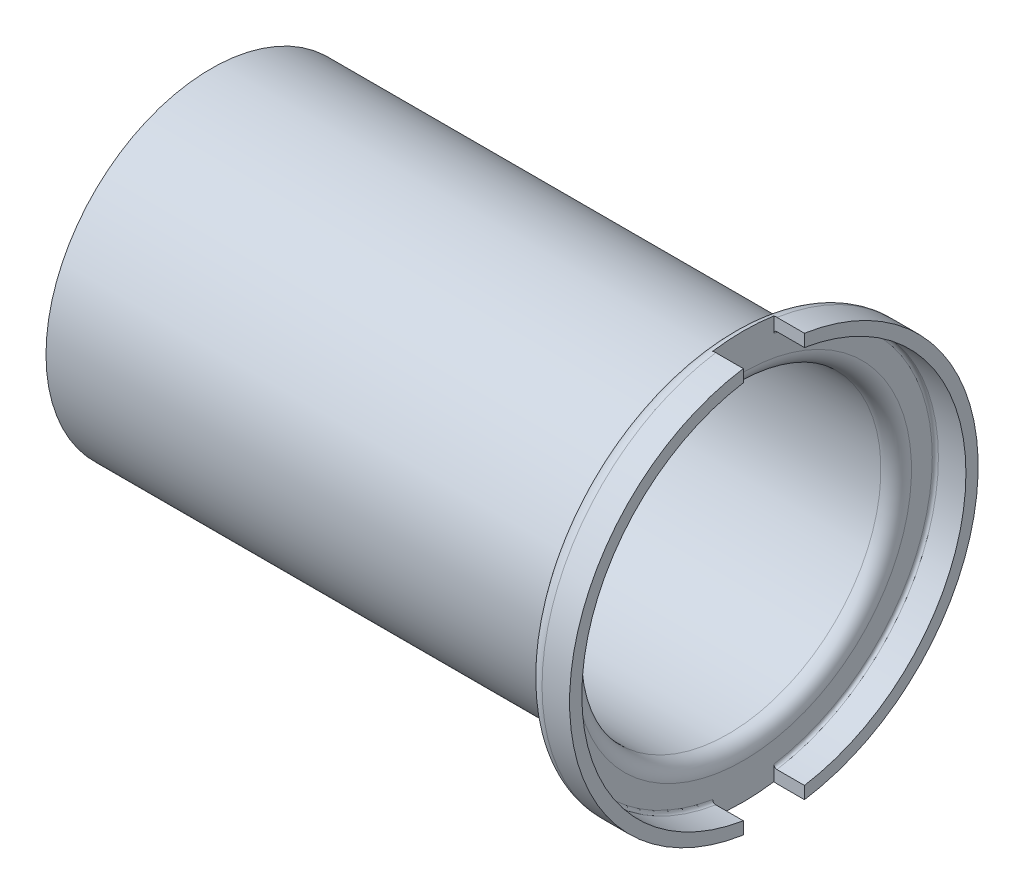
ISO-10303-21;
HEADER;
FILE_DESCRIPTION(('STEP AP214'),'2;1');
FILE_NAME('part.step','',(''),(''),'','','');
FILE_SCHEMA(('AUTOMOTIVE_DESIGN { 1 0 10303 214 1 1 1 1 }'));
ENDSEC;
DATA;
#1=APPLICATION_CONTEXT('core data for automotive mechanical design processes');
#2=APPLICATION_PROTOCOL_DEFINITION('international standard','automotive_design',2000,#1);
#3=PRODUCT_CONTEXT('',#1,'mechanical');
#4=PRODUCT('Part','Part','',(#3));
#5=PRODUCT_RELATED_PRODUCT_CATEGORY('part','',(#4));
#6=PRODUCT_DEFINITION_FORMATION('','',#4);
#7=PRODUCT_DEFINITION_CONTEXT('part definition',#1,'design');
#8=PRODUCT_DEFINITION('design','',#6,#7);
#9=PRODUCT_DEFINITION_SHAPE('','',#8);
#10=(LENGTH_UNIT() NAMED_UNIT(*) SI_UNIT(.MILLI.,.METRE.));
#11=(NAMED_UNIT(*) PLANE_ANGLE_UNIT() SI_UNIT($,.RADIAN.));
#12=(NAMED_UNIT(*) SI_UNIT($,.STERADIAN.) SOLID_ANGLE_UNIT());
#13=UNCERTAINTY_MEASURE_WITH_UNIT(LENGTH_MEASURE(1.E-05),#10,'distance_accuracy_value','');
#14=(GEOMETRIC_REPRESENTATION_CONTEXT(3) GLOBAL_UNCERTAINTY_ASSIGNED_CONTEXT((#13)) GLOBAL_UNIT_ASSIGNED_CONTEXT((#10,
#11,#12)) REPRESENTATION_CONTEXT('',''));
#15=CARTESIAN_POINT('',(0.,0.,0.));
#16=DIRECTION('',(0.,0.,1.));
#17=DIRECTION('',(1.,0.,0.));
#18=AXIS2_PLACEMENT_3D('',#15,#16,#17);
#19=CARTESIAN_POINT('',(0.,0.,0.));
#20=DIRECTION('',(-1.,0.,0.));
#21=DIRECTION('',(0.,0.,1.));
#22=AXIS2_PLACEMENT_3D('',#19,#20,#21);
#23=CYLINDRICAL_SURFACE('',#22,31.4);
#24=CARTESIAN_POINT('',(87.5,0.,0.));
#25=DIRECTION('',(-1.,0.,0.));
#26=DIRECTION('',(0.,0.,1.));
#27=AXIS2_PLACEMENT_3D('',#24,#25,#26);
#28=CIRCLE('',#27,31.4);
#29=CARTESIAN_POINT('',(87.5,-30.9993548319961,5.));
#30=VERTEX_POINT('',#29);
#31=CARTESIAN_POINT('',(87.5000000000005,30.9993548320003,5.));
#32=VERTEX_POINT('',#31);
#33=EDGE_CURVE('E252',#30,#32,#28,.T.);
#34=ORIENTED_EDGE('',*,*,#33,.T.);
#35=DIRECTION('',(-1.,0.,0.));
#36=VECTOR('',#35,1.);
#37=CARTESIAN_POINT('',(0.,30.9993548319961,5.00000000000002));
#38=LINE('',#37,#36);
#39=CARTESIAN_POINT('',(92.,30.9993548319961,5.));
#40=VERTEX_POINT('',#39);
#41=EDGE_CURVE('E201',#32,#40,#38,.F.);
#42=ORIENTED_EDGE('',*,*,#41,.T.);
#43=CARTESIAN_POINT('',(92.,0.,0.));
#44=DIRECTION('',(-1.,0.,0.));
#45=DIRECTION('',(0.,0.,1.));
#46=AXIS2_PLACEMENT_3D('',#43,#44,#45);
#47=CIRCLE('',#46,31.4);
#48=CARTESIAN_POINT('',(92.,-30.9993548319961,5.));
#49=VERTEX_POINT('',#48);
#50=EDGE_CURVE('E216',#49,#40,#47,.T.);
#51=ORIENTED_EDGE('',*,*,#50,.F.);
#52=DIRECTION('',(-1.,0.,0.));
#53=VECTOR('',#52,1.);
#54=CARTESIAN_POINT('',(0.,-30.9993548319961,5.00000000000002));
#55=LINE('',#54,#53);
#56=EDGE_CURVE('E213',#49,#30,#55,.T.);
#57=ORIENTED_EDGE('',*,*,#56,.T.);
#58=EDGE_LOOP('',(#34,#42,#51,#57));
#59=FACE_BOUND('',#58,.T.);
#60=ADVANCED_FACE('F32',(#59),#23,.F.);
#61=CARTESIAN_POINT('',(87.5,0.,0.));
#62=DIRECTION('',(-1.,0.,0.));
#63=DIRECTION('',(0.,0.,1.));
#64=AXIS2_PLACEMENT_3D('',#61,#62,#63);
#65=TOROIDAL_SURFACE('',#64,30.9,0.5);
#66=ORIENTED_EDGE('',*,*,#33,.F.);
#67=CARTESIAN_POINT('',(87.2534090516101,-30.9334756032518,5.));
#68=CARTESIAN_POINT('',(87.2289089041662,-30.919404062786,5.));
#69=CARTESIAN_POINT('',(87.2055893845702,-30.9032325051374,5.));
#70=CARTESIAN_POINT('',(87.1619882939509,-30.8671774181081,5.));
#71=CARTESIAN_POINT('',(87.1417108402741,-30.8472889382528,5.));
#72=CARTESIAN_POINT('',(87.1047906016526,-30.80441830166,5.));
#73=CARTESIAN_POINT('',(87.0881441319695,-30.781439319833,5.));
#74=CARTESIAN_POINT('',(87.0589087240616,-30.7330414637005,5.));
#75=CARTESIAN_POINT('',(87.0463187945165,-30.7076231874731,5.));
#76=CARTESIAN_POINT('',(87.0254177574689,-30.6548088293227,5.));
#77=CARTESIAN_POINT('',(87.0171477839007,-30.6273964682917,5.));
#78=CARTESIAN_POINT('',(87.0052796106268,-30.5715769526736,5.));
#79=CARTESIAN_POINT('',(87.0016818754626,-30.5431696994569,5.));
#80=CARTESIAN_POINT('',(86.9992392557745,-30.4858875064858,5.));
#81=CARTESIAN_POINT('',(87.000438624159,-30.4570106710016,5.));
#82=CARTESIAN_POINT('',(87.0076582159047,-30.3998653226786,5.));
#83=CARTESIAN_POINT('',(87.0136785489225,-30.3715968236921,5.));
#84=CARTESIAN_POINT('',(87.0303972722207,-30.31642146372,5.));
#85=CARTESIAN_POINT('',(87.0411041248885,-30.2895171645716,5.));
#86=CARTESIAN_POINT('',(87.0669121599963,-30.237904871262,5.));
#87=CARTESIAN_POINT('',(87.0820132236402,-30.2131968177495,5.));
#88=CARTESIAN_POINT('',(87.1160829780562,-30.1668639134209,5.));
#89=CARTESIAN_POINT('',(87.1350250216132,-30.1452194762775,5.));
#90=CARTESIAN_POINT('',(87.176315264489,-30.1054674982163,5.));
#91=CARTESIAN_POINT('',(87.1986632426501,-30.0873597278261,5.));
#92=CARTESIAN_POINT('',(87.2458342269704,-30.0554384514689,5.));
#93=CARTESIAN_POINT('',(87.2706229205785,-30.0415742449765,5.));
#94=CARTESIAN_POINT('',(87.3221978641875,-30.0182655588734,5.));
#95=CARTESIAN_POINT('',(87.3489839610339,-30.0088207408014,5.));
#96=CARTESIAN_POINT('',(87.4034312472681,-29.9947360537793,5.));
#97=CARTESIAN_POINT('',(87.4310772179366,-29.9900373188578,5.));
#98=CARTESIAN_POINT('',(87.4867651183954,-29.985383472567,5.));
#99=CARTESIAN_POINT('',(87.5148070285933,-29.9854281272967,5.));
#100=CARTESIAN_POINT('',(87.5702876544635,-29.9902425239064,5.));
#101=CARTESIAN_POINT('',(87.5977291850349,-29.9949799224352,5.));
#102=CARTESIAN_POINT('',(87.6514295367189,-30.0089860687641,5.));
#103=CARTESIAN_POINT('',(87.6776883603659,-30.0182548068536,5.));
#104=CARTESIAN_POINT('',(87.728340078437,-30.0410657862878,5.));
#105=CARTESIAN_POINT('',(87.7527291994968,-30.0546164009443,5.));
#106=CARTESIAN_POINT('',(87.7989154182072,-30.0855822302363,5.));
#107=CARTESIAN_POINT('',(87.8207124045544,-30.1029976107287,5.));
#108=CARTESIAN_POINT('',(87.8613285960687,-30.1413748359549,5.));
#109=CARTESIAN_POINT('',(87.880116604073,-30.1623696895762,5.));
#110=CARTESIAN_POINT('',(87.9139562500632,-30.2071803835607,5.));
#111=CARTESIAN_POINT('',(87.9290076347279,-30.2309964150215,5.));
#112=CARTESIAN_POINT('',(87.9551551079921,-30.2811090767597,5.));
#113=CARTESIAN_POINT('',(87.9661965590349,-30.3074342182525,5.));
#114=CARTESIAN_POINT('',(87.9837566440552,-30.3615521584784,5.));
#115=CARTESIAN_POINT('',(87.9902749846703,-30.389345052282,5.));
#116=CARTESIAN_POINT('',(87.9986657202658,-30.4459297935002,5.));
#117=CARTESIAN_POINT('',(88.0004874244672,-30.4747291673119,5.));
#118=CARTESIAN_POINT('',(87.9992898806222,-30.5322277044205,5.));
#119=CARTESIAN_POINT('',(87.99627047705,-30.5609268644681,5.));
#120=CARTESIAN_POINT('',(87.9854476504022,-30.6175196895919,5.));
#121=CARTESIAN_POINT('',(87.9776265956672,-30.6454099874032,5.));
#122=CARTESIAN_POINT('',(87.9573907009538,-30.6994721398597,5.));
#123=CARTESIAN_POINT('',(87.9449759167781,-30.7256440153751,5.));
#124=CARTESIAN_POINT('',(87.9159578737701,-30.7753821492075,5.));
#125=CARTESIAN_POINT('',(87.8993753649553,-30.7989605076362,5.));
#126=CARTESIAN_POINT('',(87.8624456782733,-30.8429584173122,5.));
#127=CARTESIAN_POINT('',(87.8420987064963,-30.8633781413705,5.));
#128=CARTESIAN_POINT('',(87.7984581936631,-30.9002313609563,5.));
#129=CARTESIAN_POINT('',(87.7752001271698,-30.9167068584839,5.));
#130=CARTESIAN_POINT('',(87.7262207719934,-30.94546032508,5.));
#131=CARTESIAN_POINT('',(87.7004997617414,-30.9577387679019,5.));
#132=CARTESIAN_POINT('',(87.6476734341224,-30.977591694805,5.));
#133=CARTESIAN_POINT('',(87.6205896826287,-30.9852235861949,5.));
#134=CARTESIAN_POINT('',(87.5655133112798,-30.9957904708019,5.));
#135=CARTESIAN_POINT('',(87.5375205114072,-30.9987245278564,5.));
#136=CARTESIAN_POINT('',(87.4816685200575,-30.9997986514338,5.));
#137=CARTESIAN_POINT('',(87.4538100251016,-30.9979764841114,5.));
#138=CARTESIAN_POINT('',(87.3988208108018,-30.9896736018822,5.));
#139=CARTESIAN_POINT('',(87.371689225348,-30.983198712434,5.));
#140=CARTESIAN_POINT('',(87.3293467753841,-30.9692469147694,5.));
#141=CARTESIAN_POINT('',(87.3136585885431,-30.9631748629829,5.));
#142=CARTESIAN_POINT('',(87.2829773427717,-30.9494748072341,5.));
#143=CARTESIAN_POINT('',(87.2679842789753,-30.9418468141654,5.));
#144=CARTESIAN_POINT('',(87.2534090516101,-30.9334756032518,5.));
#145=B_SPLINE_CURVE_WITH_KNOTS('',3,(#67,#68,#69,#70,#71,#72,#73,#74,#75,#76,#77,#78,#79,#80,
#81,#82,#83,#84,#85,#86,#87,#88,#89,#90,#91,#92,#93,#94,#95,#96,#97,#98,#99,#100,#101,#102,#103,
#104,#105,#106,#107,#108,#109,#110,#111,#112,#113,#114,#115,#116,#117,#118,#119,#120,#121,#122,
#123,#124,#125,#126,#127,#128,#129,#130,#131,#132,#133,#134,#135,#136,#137,#138,#139,#140,#141,
#142,#143,#144),.UNSPECIFIED.,.T.,.F.,(4,2,2,2,2,2,2,2,2,2,2,2,2,2,2,2,2,2,2,2,2,2,2,2,2,2,2,2,
2,2,2,2,2,2,2,2,2,2,4),(0.,0.0846984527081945,0.16951052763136,0.254236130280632,
0.338941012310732,0.424438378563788,0.50994424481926,0.596240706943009,0.682539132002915,
0.768994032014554,0.855446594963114,0.941318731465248,1.02718529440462,1.1119818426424,
1.19677189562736,1.28049687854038,1.36421773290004,1.44736555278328,1.53051319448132,
1.61382445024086,1.69713928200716,1.78126867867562,1.86540377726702,1.95064569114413,
2.03589313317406,2.12205687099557,2.20822337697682,2.29470819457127,2.38119196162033,
2.46725339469,2.55331011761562,2.63840501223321,2.72349029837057,2.8075018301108,
2.89153010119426,2.97489319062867,3.05815208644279,3.10853985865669,3.15892727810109),.UNSPECIFIED.);
#146=CARTESIAN_POINT('',(87.,-30.4927860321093,5.));
#147=VERTEX_POINT('',#146);
#148=EDGE_CURVE('E208',#30,#147,#145,.T.);
#149=ORIENTED_EDGE('',*,*,#148,.T.);
#150=CARTESIAN_POINT('',(87.,0.,0.));
#151=DIRECTION('',(-1.,0.,0.));
#152=DIRECTION('',(0.,0.,1.));
#153=AXIS2_PLACEMENT_3D('',#150,#151,#152);
#154=CIRCLE('',#153,30.9);
#155=CARTESIAN_POINT('',(87.,30.4927860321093,5.));
#156=VERTEX_POINT('',#155);
#157=EDGE_CURVE('E248',#147,#156,#154,.T.);
#158=ORIENTED_EDGE('',*,*,#157,.T.);
#159=CARTESIAN_POINT('',(87.1171087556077,30.1668960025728,4.99999999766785));
#160=CARTESIAN_POINT('',(87.0988467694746,30.1889405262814,4.99999999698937));
#161=CARTESIAN_POINT('',(87.0824479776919,30.212557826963,4.99999999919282));
#162=CARTESIAN_POINT('',(87.0538432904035,30.2622359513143,5.00000000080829));
#163=CARTESIAN_POINT('',(87.0416431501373,30.2883000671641,5.00000000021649));
#164=CARTESIAN_POINT('',(87.0217878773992,30.3420809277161,4.9999999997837));
#165=CARTESIAN_POINT('',(87.0141286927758,30.369796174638,4.99999999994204));
#166=CARTESIAN_POINT('',(87.0035421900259,30.426106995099,5.00000000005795));
#167=CARTESIAN_POINT('',(87.0006136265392,30.4547023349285,5.00000000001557));
#168=CARTESIAN_POINT('',(86.9995567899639,30.5121614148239,4.99999999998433));
#169=CARTESIAN_POINT('',(87.0014586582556,30.5410257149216,4.9999999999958));
#170=CARTESIAN_POINT('',(87.01007859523,30.5980282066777,5.0000000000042));
#171=CARTESIAN_POINT('',(87.016796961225,30.6261663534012,5.00000000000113));
#172=CARTESIAN_POINT('',(87.0348778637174,30.680921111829,4.99999999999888));
#173=CARTESIAN_POINT('',(87.0462420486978,30.7075371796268,4.9999999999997));
#174=CARTESIAN_POINT('',(87.0733113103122,30.7584629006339,5.0000000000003));
#175=CARTESIAN_POINT('',(87.0890162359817,30.7827726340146,5.00000000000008));
#176=CARTESIAN_POINT('',(87.1241992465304,30.8281868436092,4.99999999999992));
#177=CARTESIAN_POINT('',(87.1436470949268,30.849314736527,4.99999999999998));
#178=CARTESIAN_POINT('',(87.1858533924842,30.8879552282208,5.00000000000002));
#179=CARTESIAN_POINT('',(87.20861161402,30.9054680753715,5.00000000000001));
#180=CARTESIAN_POINT('',(87.2564914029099,30.9361495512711,5.));
#181=CARTESIAN_POINT('',(87.281580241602,30.9493692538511,5.));
#182=CARTESIAN_POINT('',(87.3336397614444,30.9713524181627,5.));
#183=CARTESIAN_POINT('',(87.360610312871,30.9801161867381,5.));
#184=CARTESIAN_POINT('',(87.4153334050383,30.9928410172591,5.));
#185=CARTESIAN_POINT('',(87.4430733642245,30.9968562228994,5.));
#186=CARTESIAN_POINT('',(87.4988324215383,31.0001427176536,5.));
#187=CARTESIAN_POINT('',(87.526851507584,30.9994142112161,5.));
#188=CARTESIAN_POINT('',(87.5822041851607,30.9932540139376,5.));
#189=CARTESIAN_POINT('',(87.609540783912,30.9878492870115,5.));
#190=CARTESIAN_POINT('',(87.6629217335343,30.9725375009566,5.));
#191=CARTESIAN_POINT('',(87.6889660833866,30.9626304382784,5.));
#192=CARTESIAN_POINT('',(87.7390960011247,30.9385826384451,5.));
#193=CARTESIAN_POINT('',(87.7631767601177,30.9244318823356,5.));
#194=CARTESIAN_POINT('',(87.8086497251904,30.8923240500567,5.));
#195=CARTESIAN_POINT('',(87.8300418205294,30.874366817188,5.));
#196=CARTESIAN_POINT('',(87.8697505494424,30.8349801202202,5.));
#197=CARTESIAN_POINT('',(87.888036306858,30.8135195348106,5.));
#198=CARTESIAN_POINT('',(87.9207987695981,30.7678654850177,5.));
#199=CARTESIAN_POINT('',(87.9352752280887,30.7436718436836,5.));
#200=CARTESIAN_POINT('',(87.9601998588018,30.6929128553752,5.));
#201=CARTESIAN_POINT('',(87.9705951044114,30.666321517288,5.));
#202=CARTESIAN_POINT('',(87.9868262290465,30.6117818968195,5.));
#203=CARTESIAN_POINT('',(87.9926618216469,30.5838335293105,5.));
#204=CARTESIAN_POINT('',(87.9996613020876,30.5270593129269,5.));
#205=CARTESIAN_POINT('',(88.000775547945,30.4982273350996,5.));
#206=CARTESIAN_POINT('',(87.9981682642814,30.4407821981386,5.));
#207=CARTESIAN_POINT('',(87.9944465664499,30.4121690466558,5.));
#208=CARTESIAN_POINT('',(87.9822411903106,30.3558611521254,5.));
#209=CARTESIAN_POINT('',(87.9737393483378,30.328170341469,5.));
#210=CARTESIAN_POINT('',(87.9521857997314,30.2746189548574,5.));
#211=CARTESIAN_POINT('',(87.9391341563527,30.2487583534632,5.));
#212=CARTESIAN_POINT('',(87.9089058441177,30.1997420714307,5.));
#213=CARTESIAN_POINT('',(87.8917492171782,30.1765740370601,5.));
#214=CARTESIAN_POINT('',(87.8537481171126,30.1334895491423,5.));
#215=CARTESIAN_POINT('',(87.8329038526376,30.1135729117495,4.99999999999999));
#216=CARTESIAN_POINT('',(87.7883731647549,30.0778065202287,5.00000000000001));
#217=CARTESIAN_POINT('',(87.7647222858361,30.0619125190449,5.00000000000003));
#218=CARTESIAN_POINT('',(87.7150597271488,30.0343825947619,4.99999999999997));
#219=CARTESIAN_POINT('',(87.6890482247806,30.0227463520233,4.99999999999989));
#220=CARTESIAN_POINT('',(87.6357694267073,30.0042183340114,5.00000000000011));
#221=CARTESIAN_POINT('',(87.6085230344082,29.9972664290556,5.0000000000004));
#222=CARTESIAN_POINT('',(87.553247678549,29.9880804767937,4.99999999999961));
#223=CARTESIAN_POINT('',(87.5252187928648,29.9858459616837,4.99999999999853));
#224=CARTESIAN_POINT('',(87.4694342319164,29.9861619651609,5.00000000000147));
#225=CARTESIAN_POINT('',(87.4416783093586,29.9886708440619,5.00000000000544));
#226=CARTESIAN_POINT('',(87.3869752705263,29.9983159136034,4.99999999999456));
#227=CARTESIAN_POINT('',(87.3600283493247,30.0054532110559,4.9999999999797));
#228=CARTESIAN_POINT('',(87.3077054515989,30.0241382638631,5.00000000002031));
#229=CARTESIAN_POINT('',(87.2823299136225,30.0356872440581,5.00000000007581));
#230=CARTESIAN_POINT('',(87.2338798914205,30.0628418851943,4.99999999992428));
#231=CARTESIAN_POINT('',(87.2108027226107,30.0784427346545,4.99999999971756));
#232=CARTESIAN_POINT('',(87.17601681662,30.1064239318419,5.00000000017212));
#233=CARTESIAN_POINT('',(87.1633883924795,30.117682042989,5.00000000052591));
#234=CARTESIAN_POINT('',(87.1393263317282,30.1414092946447,4.9999999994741));
#235=CARTESIAN_POINT('',(87.1278926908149,30.1538784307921,4.9999999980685));
#236=CARTESIAN_POINT('',(87.1171087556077,30.1668960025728,4.99999999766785));
#237=B_SPLINE_CURVE_WITH_KNOTS('',3,(#159,#160,#161,#162,#163,#164,#165,#166,#167,#168,#169,
#170,#171,#172,#173,#174,#175,#176,#177,#178,#179,#180,#181,#182,#183,#184,#185,#186,#187,#188,
#189,#190,#191,#192,#193,#194,#195,#196,#197,#198,#199,#200,#201,#202,#203,#204,#205,#206,#207,
#208,#209,#210,#211,#212,#213,#214,#215,#216,#217,#218,#219,#220,#221,#222,#223,#224,#225,#226,
#227,#228,#229,#230,#231,#232,#233,#234,#235,#236),.UNSPECIFIED.,.T.,.F.,(4,2,2,2,2,2,2,2,2,2,2,
2,2,2,2,2,2,2,2,2,2,2,2,2,2,2,2,2,2,2,2,2,2,2,2,2,2,2,4),(0.,0.0858161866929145,
0.171749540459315,0.25760609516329,0.34344004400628,0.4298109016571,0.51618709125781,
0.602593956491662,0.688997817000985,0.774730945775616,0.860458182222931,0.945124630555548,
1.02978524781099,1.11347095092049,1.19715304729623,1.28035580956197,1.36355863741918,
1.44695946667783,1.53036372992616,1.61455383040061,1.69874938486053,1.78400334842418,
1.86926266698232,1.95541624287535,2.04157281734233,2.12805900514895,2.21454399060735,
2.30061504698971,2.38668123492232,2.47175499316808,2.55682236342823,2.64077584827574,
2.72472100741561,2.80793267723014,2.89116425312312,2.97441895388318,3.0575752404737,
3.10825097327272,3.15892652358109),.UNSPECIFIED.);
#238=EDGE_CURVE('E195',#156,#32,#237,.T.);
#239=ORIENTED_EDGE('',*,*,#238,.T.);
#240=EDGE_LOOP('',(#66,#149,#158,#239));
#241=FACE_BOUND('',#240,.T.);
#242=ADVANCED_FACE('F188',(#241),#65,.F.);
#243=CARTESIAN_POINT('',(0.,0.,0.));
#244=DIRECTION('',(-1.,0.,0.));
#245=DIRECTION('',(0.,0.,1.));
#246=AXIS2_PLACEMENT_3D('',#243,#244,#245);
#247=CYLINDRICAL_SURFACE('',#246,33.4);
#248=DIRECTION('',(-1.,0.,0.));
#249=VECTOR('',#248,1.);
#250=CARTESIAN_POINT('',(0.,33.0236279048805,5.00000000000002));
#251=LINE('',#250,#249);
#252=CARTESIAN_POINT('',(87.5,33.0236279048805,5.00000000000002));
#253=VERTEX_POINT('',#252);
#254=CARTESIAN_POINT('',(92.,33.0236279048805,5.));
#255=VERTEX_POINT('',#254);
#256=EDGE_CURVE('E269',#253,#255,#251,.F.);
#257=ORIENTED_EDGE('',*,*,#256,.F.);
#258=CARTESIAN_POINT('',(87.5,0.,0.));
#259=DIRECTION('',(-1.,0.,0.));
#260=DIRECTION('',(0.,0.,1.));
#261=AXIS2_PLACEMENT_3D('',#258,#259,#260);
#262=CIRCLE('',#261,33.4);
#263=CARTESIAN_POINT('',(87.5,-33.0236279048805,5.00000000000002));
#264=VERTEX_POINT('',#263);
#265=EDGE_CURVE('E224',#264,#253,#262,.T.);
#266=ORIENTED_EDGE('',*,*,#265,.F.);
#267=DIRECTION('',(-1.,0.,0.));
#268=VECTOR('',#267,1.);
#269=CARTESIAN_POINT('',(0.,-33.0236279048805,5.00000000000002));
#270=LINE('',#269,#268);
#271=CARTESIAN_POINT('',(92.,-33.0236279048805,5.));
#272=VERTEX_POINT('',#271);
#273=EDGE_CURVE('E271',#272,#264,#270,.T.);
#274=ORIENTED_EDGE('',*,*,#273,.F.);
#275=CARTESIAN_POINT('',(92.,0.,0.));
#276=DIRECTION('',(-1.,0.,0.));
#277=DIRECTION('',(0.,0.,1.));
#278=AXIS2_PLACEMENT_3D('',#275,#276,#277);
#279=CIRCLE('',#278,33.4);
#280=EDGE_CURVE('E220',#272,#255,#279,.T.);
#281=ORIENTED_EDGE('',*,*,#280,.T.);
#282=EDGE_LOOP('',(#257,#266,#274,#281));
#283=FACE_BOUND('',#282,.T.);
#284=ADVANCED_FACE('F303',(#283),#247,.T.);
#285=CARTESIAN_POINT('',(92.,33.4,0.));
#286=DIRECTION('',(1.,0.,0.));
#287=DIRECTION('',(0.,0.,-1.));
#288=AXIS2_PLACEMENT_3D('',#285,#286,#287);
#289=PLANE('',#288);
#290=DIRECTION('',(0.,-1.,0.));
#291=VECTOR('',#290,1.);
#292=CARTESIAN_POINT('',(92.,33.4,5.));
#293=LINE('',#292,#291);
#294=EDGE_CURVE('E257',#255,#40,#293,.T.);
#295=ORIENTED_EDGE('',*,*,#294,.F.);
#296=ORIENTED_EDGE('',*,*,#280,.F.);
#297=DIRECTION('',(0.,1.,0.));
#298=VECTOR('',#297,1.);
#299=CARTESIAN_POINT('',(92.,-33.4,5.));
#300=LINE('',#299,#298);
#301=EDGE_CURVE('E292',#272,#49,#300,.T.);
#302=ORIENTED_EDGE('',*,*,#301,.T.);
#303=ORIENTED_EDGE('',*,*,#50,.T.);
#304=EDGE_LOOP('',(#295,#296,#302,#303));
#305=FACE_BOUND('',#304,.T.);
#306=ADVANCED_FACE('F304',(#305),#289,.T.);
#307=CARTESIAN_POINT('',(87.5,30.9993548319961,-5.));
#308=VERTEX_POINT('',#307);
#309=CARTESIAN_POINT('',(87.5,-30.9993548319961,-5.));
#310=VERTEX_POINT('',#309);
#311=EDGE_CURVE('E255',#308,#310,#28,.T.);
#312=ORIENTED_EDGE('',*,*,#311,.T.);
#313=DIRECTION('',(-1.,0.,0.));
#314=VECTOR('',#313,1.);
#315=CARTESIAN_POINT('',(0.,-30.9993548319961,-4.99999999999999));
#316=LINE('',#315,#314);
#317=CARTESIAN_POINT('',(92.,-30.9993548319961,-5.));
#318=VERTEX_POINT('',#317);
#319=EDGE_CURVE('E181',#310,#318,#316,.F.);
#320=ORIENTED_EDGE('',*,*,#319,.T.);
#321=CARTESIAN_POINT('',(92.,30.9993548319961,-5.));
#322=VERTEX_POINT('',#321);
#323=EDGE_CURVE('E219',#322,#318,#47,.T.);
#324=ORIENTED_EDGE('',*,*,#323,.F.);
#325=DIRECTION('',(-1.,0.,0.));
#326=VECTOR('',#325,1.);
#327=CARTESIAN_POINT('',(0.,30.9993548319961,-4.99999999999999));
#328=LINE('',#327,#326);
#329=EDGE_CURVE('E55',#322,#308,#328,.T.);
#330=ORIENTED_EDGE('',*,*,#329,.T.);
#331=EDGE_LOOP('',(#312,#320,#324,#330));
#332=FACE_BOUND('',#331,.T.);
#333=ADVANCED_FACE('F34',(#332),#23,.F.);
#334=CARTESIAN_POINT('',(87.,30.4927860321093,-5.));
#335=VERTEX_POINT('',#334);
#336=CARTESIAN_POINT('',(87.,-30.4927860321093,-5.));
#337=VERTEX_POINT('',#336);
#338=EDGE_CURVE('E251',#335,#337,#154,.T.);
#339=ORIENTED_EDGE('',*,*,#338,.T.);
#340=CARTESIAN_POINT('',(87.2534089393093,-30.9334757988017,-5.0000002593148));
#341=CARTESIAN_POINT('',(87.2775327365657,-30.9473283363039,-5.0000003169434));
#342=CARTESIAN_POINT('',(87.3028358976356,-30.9591651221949,-5.00000008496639));
#343=CARTESIAN_POINT('',(87.3550887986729,-30.9784366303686,-4.99999991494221));
#344=CARTESIAN_POINT('',(87.3820402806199,-30.9858666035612,-4.99999997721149));
#345=CARTESIAN_POINT('',(87.4368062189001,-30.9960840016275,-5.00000002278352));
#346=CARTESIAN_POINT('',(87.4646204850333,-30.9988724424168,-5.00000000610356));
#347=CARTESIAN_POINT('',(87.5203142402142,-30.9997222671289,-4.99999999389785));
#348=CARTESIAN_POINT('',(87.5481937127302,-30.9977847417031,-4.99999999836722));
#349=CARTESIAN_POINT('',(87.6031446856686,-30.9892580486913,-5.00000000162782));
#350=CARTESIAN_POINT('',(87.6302183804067,-30.9826830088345,-5.00000000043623));
#351=CARTESIAN_POINT('',(87.6828840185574,-30.9650956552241,-4.99999999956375));
#352=CARTESIAN_POINT('',(87.7084759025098,-30.9540831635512,-4.99999999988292));
#353=CARTESIAN_POINT('',(87.7575501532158,-30.9279054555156,-5.00000000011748));
#354=CARTESIAN_POINT('',(87.7810250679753,-30.9127262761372,-5.00000000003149));
#355=CARTESIAN_POINT('',(87.8251260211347,-30.8786791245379,-4.99999999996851));
#356=CARTESIAN_POINT('',(87.8457519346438,-30.859810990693,-4.99999999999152));
#357=CARTESIAN_POINT('',(87.8837960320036,-30.8187223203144,-5.00000000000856));
#358=CARTESIAN_POINT('',(87.9011797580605,-30.7964698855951,-5.0000000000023));
#359=CARTESIAN_POINT('',(87.9320196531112,-30.7493926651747,-4.9999999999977));
#360=CARTESIAN_POINT('',(87.9454755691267,-30.7245677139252,-4.99999999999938));
#361=CARTESIAN_POINT('',(87.9682551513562,-30.672714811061,-5.00000000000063));
#362=CARTESIAN_POINT('',(87.9775245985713,-30.6456630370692,-5.00000000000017));
#363=CARTESIAN_POINT('',(87.9914402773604,-30.5903952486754,-4.99999999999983));
#364=CARTESIAN_POINT('',(87.996086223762,-30.5621791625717,-4.99999999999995));
#365=CARTESIAN_POINT('',(88.0006588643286,-30.5050863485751,-5.00000000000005));
#366=CARTESIAN_POINT('',(88.0005385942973,-30.4762058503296,-5.00000000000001));
#367=CARTESIAN_POINT('',(87.9954661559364,-30.418871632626,-4.99999999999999));
#368=CARTESIAN_POINT('',(87.9905138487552,-30.390417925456,-5.));
#369=CARTESIAN_POINT('',(87.9758867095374,-30.3346660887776,-5.));
#370=CARTESIAN_POINT('',(87.9661988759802,-30.307371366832,-5.));
#371=CARTESIAN_POINT('',(87.9423522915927,-30.2548092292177,-5.));
#372=CARTESIAN_POINT('',(87.9281936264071,-30.2295417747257,-5.));
#373=CARTESIAN_POINT('',(87.8958842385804,-30.1819173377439,-5.));
#374=CARTESIAN_POINT('',(87.8777572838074,-30.159544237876,-5.));
#375=CARTESIAN_POINT('',(87.8379628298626,-30.118205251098,-5.));
#376=CARTESIAN_POINT('',(87.8162955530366,-30.0992391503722,-5.));
#377=CARTESIAN_POINT('',(87.7703131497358,-30.0655004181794,-5.));
#378=CARTESIAN_POINT('',(87.7460331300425,-30.0506799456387,-5.));
#379=CARTESIAN_POINT('',(87.6953047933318,-30.0253874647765,-5.));
#380=CARTESIAN_POINT('',(87.6688566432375,-30.0149151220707,-5.));
#381=CARTESIAN_POINT('',(87.6149089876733,-29.9987517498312,-5.));
#382=CARTESIAN_POINT('',(87.5874273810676,-29.9930009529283,-5.));
#383=CARTESIAN_POINT('',(87.5318876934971,-29.9862346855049,-5.));
#384=CARTESIAN_POINT('',(87.5038296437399,-29.9852189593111,-5.));
#385=CARTESIAN_POINT('',(87.4481632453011,-29.9879434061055,-5.));
#386=CARTESIAN_POINT('',(87.4205530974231,-29.9916470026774,-5.));
#387=CARTESIAN_POINT('',(87.3663461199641,-30.0036332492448,-5.));
#388=CARTESIAN_POINT('',(87.3397492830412,-30.0119158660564,-5.));
#389=CARTESIAN_POINT('',(87.2882899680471,-30.0328185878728,-5.));
#390=CARTESIAN_POINT('',(87.2634291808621,-30.0454428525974,-4.99999999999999));
#391=CARTESIAN_POINT('',(87.2161543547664,-30.0746500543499,-5.00000000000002));
#392=CARTESIAN_POINT('',(87.1937404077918,-30.0912331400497,-5.00000000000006));
#393=CARTESIAN_POINT('',(87.1517721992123,-30.1280414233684,-4.99999999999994));
#394=CARTESIAN_POINT('',(87.132245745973,-30.1482983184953,-4.99999999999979));
#395=CARTESIAN_POINT('',(87.09681764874,-30.1917658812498,-5.00000000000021));
#396=CARTESIAN_POINT('',(87.0809162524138,-30.2149767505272,-5.00000000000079));
#397=CARTESIAN_POINT('',(87.0529698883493,-30.2640177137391,-4.9999999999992));
#398=CARTESIAN_POINT('',(87.0409780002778,-30.289878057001,-4.999999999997));
#399=CARTESIAN_POINT('',(87.0214505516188,-30.3432298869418,-5.000000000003));
#400=CARTESIAN_POINT('',(87.0139152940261,-30.3707214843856,-5.00000000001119));
#401=CARTESIAN_POINT('',(87.0034360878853,-30.4268888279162,-4.99999999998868));
#402=CARTESIAN_POINT('',(87.0005450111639,-30.4555744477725,-4.99999999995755));
#403=CARTESIAN_POINT('',(86.9995952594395,-30.5130251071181,-5.00000000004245));
#404=CARTESIAN_POINT('',(87.0015365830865,-30.5417901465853,-5.0000000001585));
#405=CARTESIAN_POINT('',(87.0102219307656,-30.5987199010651,-4.99999999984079));
#406=CARTESIAN_POINT('',(87.0169876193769,-30.6268813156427,-4.99999999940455));
#407=CARTESIAN_POINT('',(87.0351715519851,-30.6816691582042,-5.00000000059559));
#408=CARTESIAN_POINT('',(87.0465909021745,-30.70829521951,-5.00000000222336));
#409=CARTESIAN_POINT('',(87.0737258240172,-30.7591382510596,-4.99999999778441));
#410=CARTESIAN_POINT('',(87.0894262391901,-30.7833633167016,-4.99999999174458));
#411=CARTESIAN_POINT('',(87.1247024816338,-30.8287736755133,-5.00000000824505));
#412=CARTESIAN_POINT('',(87.1442734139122,-30.849962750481,-5.00000003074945));
#413=CARTESIAN_POINT('',(87.1789269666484,-30.881564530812,-4.9999999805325));
#414=CARTESIAN_POINT('',(87.1930218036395,-30.893078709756,-4.99999993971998));
#415=CARTESIAN_POINT('',(87.2223794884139,-30.9145075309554,-5.00000006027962));
#416=CARTESIAN_POINT('',(87.2376423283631,-30.9244221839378,-5.00000022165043));
#417=CARTESIAN_POINT('',(87.2534089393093,-30.9334757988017,-5.0000002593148));
#418=B_SPLINE_CURVE_WITH_KNOTS('',3,(#340,#341,#342,#343,#344,#345,#346,#347,#348,#349,#350,
#351,#352,#353,#354,#355,#356,#357,#358,#359,#360,#361,#362,#363,#364,#365,#366,#367,#368,#369,
#370,#371,#372,#373,#374,#375,#376,#377,#378,#379,#380,#381,#382,#383,#384,#385,#386,#387,#388,
#389,#390,#391,#392,#393,#394,#395,#396,#397,#398,#399,#400,#401,#402,#403,#404,#405,#406,#407,
#408,#409,#410,#411,#412,#413,#414,#415,#416,#417),.UNSPECIFIED.,.T.,.F.,(4,2,2,2,2,2,2,2,2,2,2,
2,2,2,2,2,2,2,2,2,2,2,2,2,2,2,2,2,2,2,2,2,2,2,2,2,2,2,4),(0.,0.0833887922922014,
0.166867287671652,0.250327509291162,0.333768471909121,0.416956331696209,0.500147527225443,
0.583620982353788,0.667098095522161,0.751417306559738,0.835741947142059,0.92112938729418,
1.00652209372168,1.092756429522,1.17899324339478,1.26546816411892,1.35194142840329,
1.43791028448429,1.52387374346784,1.6087998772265,1.69371947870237,1.77754679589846,
1.86136958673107,1.94454665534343,2.02772312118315,2.1109795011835,2.19423900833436,
2.27825437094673,2.36227547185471,2.44739393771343,2.53251818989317,2.61860484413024,
2.70469147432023,2.79116714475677,2.87766338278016,2.96385728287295,3.04994286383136,
3.10444371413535,3.15894419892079),.UNSPECIFIED.);
#419=EDGE_CURVE('E134',#337,#310,#418,.T.);
#420=ORIENTED_EDGE('',*,*,#419,.T.);
#421=ORIENTED_EDGE('',*,*,#311,.F.);
#422=CARTESIAN_POINT('',(87.1171087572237,30.1668960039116,-5.));
#423=CARTESIAN_POINT('',(87.1350369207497,30.1452582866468,-5.));
#424=CARTESIAN_POINT('',(87.1547858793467,30.1251047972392,-5.));
#425=CARTESIAN_POINT('',(87.1973937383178,30.0883712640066,-5.));
#426=CARTESIAN_POINT('',(87.2202558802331,30.0717949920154,-5.));
#427=CARTESIAN_POINT('',(87.2684511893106,30.0427285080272,-5.));
#428=CARTESIAN_POINT('',(87.2937845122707,30.0302385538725,-5.));
#429=CARTESIAN_POINT('',(87.3461958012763,30.0097349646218,-5.));
#430=CARTESIAN_POINT('',(87.3732733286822,30.0017202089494,-5.));
#431=CARTESIAN_POINT('',(87.4281643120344,29.9904597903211,-5.));
#432=CARTESIAN_POINT('',(87.4559696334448,29.9871744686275,-5.));
#433=CARTESIAN_POINT('',(87.5117360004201,29.9853477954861,-5.));
#434=CARTESIAN_POINT('',(87.539697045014,29.9868064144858,-5.));
#435=CARTESIAN_POINT('',(87.5948149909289,29.994400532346,-5.));
#436=CARTESIAN_POINT('',(87.6219755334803,30.0005096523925,-5.));
#437=CARTESIAN_POINT('',(87.6748904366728,30.017186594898,-5.));
#438=CARTESIAN_POINT('',(87.700644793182,30.027754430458,-5.));
#439=CARTESIAN_POINT('',(87.7501142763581,30.053072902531,-5.));
#440=CARTESIAN_POINT('',(87.7738224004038,30.0678372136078,-5.));
#441=CARTESIAN_POINT('',(87.8184571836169,30.1010971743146,-5.));
#442=CARTESIAN_POINT('',(87.8393837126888,30.1195929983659,-5.));
#443=CARTESIAN_POINT('',(87.8781031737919,30.1599964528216,-5.));
#444=CARTESIAN_POINT('',(87.8958604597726,30.1819382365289,-5.));
#445=CARTESIAN_POINT('',(87.927496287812,30.2284590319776,-5.));
#446=CARTESIAN_POINT('',(87.9413745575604,30.2530382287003,-5.));
#447=CARTESIAN_POINT('',(87.9650487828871,30.3044831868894,-5.));
#448=CARTESIAN_POINT('',(87.9747885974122,30.33137478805,-5.));
#449=CARTESIAN_POINT('',(87.9896655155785,30.3864025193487,-5.));
#450=CARTESIAN_POINT('',(87.9948023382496,30.4145387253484,-5.));
#451=CARTESIAN_POINT('',(88.0003679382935,30.4715561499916,-5.));
#452=CARTESIAN_POINT('',(88.0007494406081,30.500441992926,-5.));
#453=CARTESIAN_POINT('',(87.9966708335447,30.5578705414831,-5.));
#454=CARTESIAN_POINT('',(87.9922105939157,30.5864132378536,-5.));
#455=CARTESIAN_POINT('',(87.9785469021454,30.6424143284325,-5.));
#456=CARTESIAN_POINT('',(87.9693319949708,30.669869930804,-5.));
#457=CARTESIAN_POINT('',(87.9463962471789,30.722830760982,-5.));
#458=CARTESIAN_POINT('',(87.93267550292,30.7483360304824,-5.));
#459=CARTESIAN_POINT('',(87.9011957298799,30.7964996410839,-5.));
#460=CARTESIAN_POINT('',(87.8834616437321,30.8191742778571,-5.));
#461=CARTESIAN_POINT('',(87.8443970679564,30.8611799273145,-5.));
#462=CARTESIAN_POINT('',(87.8230667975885,30.8805111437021,-5.));
#463=CARTESIAN_POINT('',(87.7776818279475,30.9150359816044,-5.));
#464=CARTESIAN_POINT('',(87.7536620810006,30.9302755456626,-5.));
#465=CARTESIAN_POINT('',(87.7033804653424,30.956447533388,-5.));
#466=CARTESIAN_POINT('',(87.6771187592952,30.9673802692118,-5.));
#467=CARTESIAN_POINT('',(87.6234443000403,30.9844933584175,-5.));
#468=CARTESIAN_POINT('',(87.5960495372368,30.9907301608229,-5.));
#469=CARTESIAN_POINT('',(87.5406000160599,30.9984777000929,-5.));
#470=CARTESIAN_POINT('',(87.5125452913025,30.9999886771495,-5.));
#471=CARTESIAN_POINT('',(87.4567937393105,30.9982447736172,-5.));
#472=CARTESIAN_POINT('',(87.42909580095,30.995025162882,-5.));
#473=CARTESIAN_POINT('',(87.3746339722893,30.9839828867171,-5.));
#474=CARTESIAN_POINT('',(87.3478700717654,30.9761602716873,-5.));
#475=CARTESIAN_POINT('',(87.2960174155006,30.9561442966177,-5.));
#476=CARTESIAN_POINT('',(87.2709294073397,30.9439490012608,-5.));
#477=CARTESIAN_POINT('',(87.2231348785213,30.9155517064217,-5.));
#478=CARTESIAN_POINT('',(87.2004284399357,30.8993495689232,-5.));
#479=CARTESIAN_POINT('',(87.1578408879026,30.8632664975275,-5.));
#480=CARTESIAN_POINT('',(87.1379839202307,30.8433570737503,-5.));
#481=CARTESIAN_POINT('',(87.1018450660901,30.8005226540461,-5.));
#482=CARTESIAN_POINT('',(87.0855634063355,30.7775974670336,-5.));
#483=CARTESIAN_POINT('',(87.056824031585,30.7290813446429,-5.));
#484=CARTESIAN_POINT('',(87.0444158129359,30.7034610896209,-5.));
#485=CARTESIAN_POINT('',(87.0240215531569,30.6505183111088,-5.));
#486=CARTESIAN_POINT('',(87.0160356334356,30.6231957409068,-5.));
#487=CARTESIAN_POINT('',(87.0046247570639,30.5672906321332,-5.));
#488=CARTESIAN_POINT('',(87.0012525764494,30.5386973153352,-5.));
#489=CARTESIAN_POINT('',(86.9993259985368,30.4813406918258,-5.));
#490=CARTESIAN_POINT('',(87.0007729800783,30.4525773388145,-5.));
#491=CARTESIAN_POINT('',(87.0084711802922,30.3955217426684,-5.));
#492=CARTESIAN_POINT('',(87.0147519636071,30.3672334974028,-5.));
#493=CARTESIAN_POINT('',(87.0319849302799,30.3121419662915,-5.));
#494=CARTESIAN_POINT('',(87.0429315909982,30.2853369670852,-5.));
#495=CARTESIAN_POINT('',(87.0644972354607,30.2431465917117,-5.));
#496=CARTESIAN_POINT('',(87.0738417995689,30.2270968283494,-5.));
#497=CARTESIAN_POINT('',(87.0942292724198,30.1961143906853,-5.));
#498=CARTESIAN_POINT('',(87.1052721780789,30.1811817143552,-5.));
#499=CARTESIAN_POINT('',(87.1171087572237,30.1668960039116,-5.));
#500=B_SPLINE_CURVE_WITH_KNOTS('',3,(#422,#423,#424,#425,#426,#427,#428,#429,#430,#431,#432,
#433,#434,#435,#436,#437,#438,#439,#440,#441,#442,#443,#444,#445,#446,#447,#448,#449,#450,#451,
#452,#453,#454,#455,#456,#457,#458,#459,#460,#461,#462,#463,#464,#465,#466,#467,#468,#469,#470,
#471,#472,#473,#474,#475,#476,#477,#478,#479,#480,#481,#482,#483,#484,#485,#486,#487,#488,#489,
#490,#491,#492,#493,#494,#495,#496,#497,#498,#499),.UNSPECIFIED.,.T.,.F.,(4,2,2,2,2,2,2,2,2,2,2,
2,2,2,2,2,2,2,2,2,2,2,2,2,2,2,2,2,2,2,2,2,2,2,2,2,2,2,4),(0.,0.0842334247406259,
0.168555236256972,0.252882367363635,0.337188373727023,0.420783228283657,0.504377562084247,
0.587501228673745,0.670625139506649,0.754023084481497,0.837424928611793,0.921712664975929,
1.00600631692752,1.09140954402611,1.17681798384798,1.26307484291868,1.34933402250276,
1.43580199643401,1.52226812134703,1.60821094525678,1.69414853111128,1.7790764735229,
1.86399825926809,1.94788215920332,2.03176179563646,2.11501921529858,2.19827572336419,
2.28156912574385,2.36486539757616,2.44883038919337,2.53280070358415,2.61780382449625,
2.70280927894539,2.78877919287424,2.87477370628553,2.96129840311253,3.04772097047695,
3.10333388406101,3.15894669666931),.UNSPECIFIED.);
#501=EDGE_CURVE('E144',#308,#335,#500,.T.);
#502=ORIENTED_EDGE('',*,*,#501,.T.);
#503=EDGE_LOOP('',(#339,#420,#421,#502));
#504=FACE_BOUND('',#503,.T.);
#505=ADVANCED_FACE('F183',(#504),#65,.F.);
#506=CARTESIAN_POINT('',(87.,27.5,0.));
#507=DIRECTION('',(-1.,0.,0.));
#508=DIRECTION('',(0.,0.,1.));
#509=AXIS2_PLACEMENT_3D('',#506,#507,#508);
#510=PLANE('',#509);
#511=CARTESIAN_POINT('',(87.,0.,0.));
#512=DIRECTION('',(-1.,0.,0.));
#513=DIRECTION('',(0.,0.,1.));
#514=AXIS2_PLACEMENT_3D('',#511,#512,#513);
#515=CIRCLE('',#514,27.5);
#516=CARTESIAN_POINT('',(87.,0.,27.5));
#517=VERTEX_POINT('',#516);
#518=EDGE_CURVE('E245',#517,#517,#515,.T.);
#519=ORIENTED_EDGE('',*,*,#518,.T.);
#520=EDGE_LOOP('',(#519));
#521=FACE_BOUND('',#520,.T.);
#522=ORIENTED_EDGE('',*,*,#338,.F.);
#523=DIRECTION('',(0.,1.,0.));
#524=VECTOR('',#523,1.);
#525=CARTESIAN_POINT('',(87.,-33.4,-5.));
#526=LINE('',#525,#524);
#527=CARTESIAN_POINT('',(87.,32.9725410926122,-5.));
#528=VERTEX_POINT('',#527);
#529=EDGE_CURVE('E136',#335,#528,#526,.T.);
#530=ORIENTED_EDGE('',*,*,#529,.T.);
#531=CARTESIAN_POINT('',(87.,0.,0.));
#532=DIRECTION('',(-1.,0.,0.));
#533=DIRECTION('',(0.,0.,1.));
#534=AXIS2_PLACEMENT_3D('',#531,#532,#533);
#535=CIRCLE('',#534,33.3494897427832);
#536=CARTESIAN_POINT('',(87.,32.9725410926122,5.));
#537=VERTEX_POINT('',#536);
#538=EDGE_CURVE('E36',#528,#537,#535,.F.);
#539=ORIENTED_EDGE('',*,*,#538,.T.);
#540=DIRECTION('',(0.,1.,0.));
#541=VECTOR('',#540,1.);
#542=CARTESIAN_POINT('',(87.,-33.4,5.));
#543=LINE('',#542,#541);
#544=EDGE_CURVE('E135',#156,#537,#543,.T.);
#545=ORIENTED_EDGE('',*,*,#544,.F.);
#546=ORIENTED_EDGE('',*,*,#157,.F.);
#547=CARTESIAN_POINT('',(87.,-32.9725410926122,5.));
#548=VERTEX_POINT('',#547);
#549=EDGE_CURVE('E127',#548,#147,#543,.T.);
#550=ORIENTED_EDGE('',*,*,#549,.F.);
#551=CARTESIAN_POINT('',(87.,-32.9725410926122,-5.));
#552=VERTEX_POINT('',#551);
#553=EDGE_CURVE('E11',#548,#552,#535,.F.);
#554=ORIENTED_EDGE('',*,*,#553,.T.);
#555=EDGE_CURVE('E124',#552,#337,#526,.T.);
#556=ORIENTED_EDGE('',*,*,#555,.T.);
#557=EDGE_LOOP('',(#522,#530,#539,#545,#546,#550,#554,#556));
#558=FACE_BOUND('',#557,.T.);
#559=ADVANCED_FACE('F123',(#521,#558),#510,.F.);
#560=CARTESIAN_POINT('',(84.5,0.,0.));
#561=DIRECTION('',(-1.,0.,0.));
#562=DIRECTION('',(0.,0.,1.));
#563=AXIS2_PLACEMENT_3D('',#560,#561,#562);
#564=TOROIDAL_SURFACE('',#563,27.5,2.5);
#565=ORIENTED_EDGE('',*,*,#518,.F.);
#566=EDGE_LOOP('',(#565));
#567=FACE_BOUND('',#566,.T.);
#568=CARTESIAN_POINT('',(84.5,0.,0.));
#569=DIRECTION('',(-1.,0.,0.));
#570=DIRECTION('',(0.,0.,1.));
#571=AXIS2_PLACEMENT_3D('',#568,#569,#570);
#572=CIRCLE('',#571,25.);
#573=CARTESIAN_POINT('',(84.5,0.,25.));
#574=VERTEX_POINT('',#573);
#575=EDGE_CURVE('E242',#574,#574,#572,.T.);
#576=ORIENTED_EDGE('',*,*,#575,.T.);
#577=EDGE_LOOP('',(#576));
#578=FACE_BOUND('',#577,.T.);
#579=ADVANCED_FACE('F340',(#567,#578),#564,.T.);
#580=CARTESIAN_POINT('',(0.,0.,0.));
#581=DIRECTION('',(-1.,0.,0.));
#582=DIRECTION('',(0.,0.,1.));
#583=AXIS2_PLACEMENT_3D('',#580,#581,#582);
#584=CYLINDRICAL_SURFACE('',#583,25.);
#585=ORIENTED_EDGE('',*,*,#575,.F.);
#586=EDGE_LOOP('',(#585));
#587=FACE_BOUND('',#586,.T.);
#588=CARTESIAN_POINT('',(0.,0.,0.));
#589=DIRECTION('',(-1.,0.,0.));
#590=DIRECTION('',(0.,0.,1.));
#591=AXIS2_PLACEMENT_3D('',#588,#589,#590);
#592=CIRCLE('',#591,25.);
#593=CARTESIAN_POINT('',(0.,0.,25.));
#594=VERTEX_POINT('',#593);
#595=EDGE_CURVE('E239',#594,#594,#592,.T.);
#596=ORIENTED_EDGE('',*,*,#595,.T.);
#597=EDGE_LOOP('',(#596));
#598=FACE_BOUND('',#597,.T.);
#599=ADVANCED_FACE('F348',(#587,#598),#584,.F.);
#600=CARTESIAN_POINT('',(0.,25.,0.));
#601=DIRECTION('',(-1.,0.,0.));
#602=DIRECTION('',(0.,0.,1.));
#603=AXIS2_PLACEMENT_3D('',#600,#601,#602);
#604=PLANE('',#603);
#605=CARTESIAN_POINT('',(0.,0.,0.));
#606=DIRECTION('',(-1.,0.,0.));
#607=DIRECTION('',(0.,0.,1.));
#608=AXIS2_PLACEMENT_3D('',#605,#606,#607);
#609=CIRCLE('',#608,27.);
#610=CARTESIAN_POINT('',(0.,0.,27.));
#611=VERTEX_POINT('',#610);
#612=EDGE_CURVE('E236',#611,#611,#609,.T.);
#613=ORIENTED_EDGE('',*,*,#612,.T.);
#614=EDGE_LOOP('',(#613));
#615=FACE_BOUND('',#614,.T.);
#616=ORIENTED_EDGE('',*,*,#595,.F.);
#617=EDGE_LOOP('',(#616));
#618=FACE_BOUND('',#617,.T.);
#619=ADVANCED_FACE('F356',(#615,#618),#604,.T.);
#620=CARTESIAN_POINT('',(0.,0.,0.));
#621=DIRECTION('',(-1.,0.,0.));
#622=DIRECTION('',(0.,0.,1.));
#623=AXIS2_PLACEMENT_3D('',#620,#621,#622);
#624=CYLINDRICAL_SURFACE('',#623,27.);
#625=CARTESIAN_POINT('',(84.5,0.,0.));
#626=DIRECTION('',(-1.,0.,0.));
#627=DIRECTION('',(0.,0.,1.));
#628=AXIS2_PLACEMENT_3D('',#625,#626,#627);
#629=CIRCLE('',#628,27.);
#630=CARTESIAN_POINT('',(84.5,0.,27.));
#631=VERTEX_POINT('',#630);
#632=EDGE_CURVE('E233',#631,#631,#629,.T.);
#633=ORIENTED_EDGE('',*,*,#632,.T.);
#634=EDGE_LOOP('',(#633));
#635=FACE_BOUND('',#634,.T.);
#636=ORIENTED_EDGE('',*,*,#612,.F.);
#637=EDGE_LOOP('',(#636));
#638=FACE_BOUND('',#637,.T.);
#639=ADVANCED_FACE('F365',(#635,#638),#624,.T.);
#640=CARTESIAN_POINT('',(84.5,0.,0.));
#641=DIRECTION('',(-1.,0.,0.));
#642=DIRECTION('',(0.,0.,1.));
#643=AXIS2_PLACEMENT_3D('',#640,#641,#642);
#644=TOROIDAL_SURFACE('',#643,27.5,0.5);
#645=CARTESIAN_POINT('',(85.,0.,0.));
#646=DIRECTION('',(-1.,0.,0.));
#647=DIRECTION('',(0.,0.,1.));
#648=AXIS2_PLACEMENT_3D('',#645,#646,#647);
#649=CIRCLE('',#648,27.5);
#650=CARTESIAN_POINT('',(85.,0.,27.5));
#651=VERTEX_POINT('',#650);
#652=EDGE_CURVE('E230',#651,#651,#649,.T.);
#653=ORIENTED_EDGE('',*,*,#652,.T.);
#654=EDGE_LOOP('',(#653));
#655=FACE_BOUND('',#654,.T.);
#656=ORIENTED_EDGE('',*,*,#632,.F.);
#657=EDGE_LOOP('',(#656));
#658=FACE_BOUND('',#657,.T.);
#659=ADVANCED_FACE('F374',(#655,#658),#644,.F.);
#660=CARTESIAN_POINT('',(85.,27.5,0.));
#661=DIRECTION('',(-1.,0.,0.));
#662=DIRECTION('',(0.,0.,1.));
#663=AXIS2_PLACEMENT_3D('',#660,#661,#662);
#664=PLANE('',#663);
#665=CARTESIAN_POINT('',(85.,0.,0.));
#666=DIRECTION('',(-1.,0.,0.));
#667=DIRECTION('',(0.,0.,1.));
#668=AXIS2_PLACEMENT_3D('',#665,#666,#667);
#669=CIRCLE('',#668,30.9);
#670=CARTESIAN_POINT('',(85.,0.,30.9));
#671=VERTEX_POINT('',#670);
#672=EDGE_CURVE('E227',#671,#671,#669,.T.);
#673=ORIENTED_EDGE('',*,*,#672,.T.);
#674=EDGE_LOOP('',(#673));
#675=FACE_BOUND('',#674,.T.);
#676=ORIENTED_EDGE('',*,*,#652,.F.);
#677=EDGE_LOOP('',(#676));
#678=FACE_BOUND('',#677,.T.);
#679=ADVANCED_FACE('F383',(#675,#678),#664,.T.);
#680=CARTESIAN_POINT('',(87.5,0.,0.));
#681=DIRECTION('',(-1.,0.,0.));
#682=DIRECTION('',(0.,0.,1.));
#683=AXIS2_PLACEMENT_3D('',#680,#681,#682);
#684=TOROIDAL_SURFACE('',#683,30.9,2.5);
#685=CARTESIAN_POINT('',(86.366031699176,-32.7485319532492,5.));
#686=CARTESIAN_POINT('',(86.4281974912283,-32.7805463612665,5.));
#687=CARTESIAN_POINT('',(86.491717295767,-32.8099265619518,5.));
#688=CARTESIAN_POINT('',(86.6210058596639,-32.8632289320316,5.));
#689=CARTESIAN_POINT('',(86.6867745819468,-32.8871511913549,5.));
#690=CARTESIAN_POINT('',(86.8199955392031,-32.9293148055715,5.));
#691=CARTESIAN_POINT('',(86.8874448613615,-32.9475653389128,5.));
#692=CARTESIAN_POINT('',(87.0236248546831,-32.9783027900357,5.));
#693=CARTESIAN_POINT('',(87.0923554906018,-32.9907898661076,5.));
#694=CARTESIAN_POINT('',(87.2992809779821,-33.0193787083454,5.));
#695=CARTESIAN_POINT('',(87.4387758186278,-33.0267866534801,5.));
#696=CARTESIAN_POINT('',(87.717022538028,-33.0180135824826,5.));
#697=CARTESIAN_POINT('',(87.8557744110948,-33.0018323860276,5.));
#698=CARTESIAN_POINT('',(88.0602021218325,-32.9603341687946,5.));
#699=CARTESIAN_POINT('',(88.127727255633,-32.9436306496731,5.));
#700=CARTESIAN_POINT('',(88.2611536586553,-32.9046049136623,5.));
#701=CARTESIAN_POINT('',(88.3270548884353,-32.8822825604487,5.));
#702=CARTESIAN_POINT('',(88.4568449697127,-32.8321463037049,5.));
#703=CARTESIAN_POINT('',(88.5207305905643,-32.804324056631,5.));
#704=CARTESIAN_POINT('',(88.6459469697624,-32.7434241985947,5.));
#705=CARTESIAN_POINT('',(88.7072776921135,-32.7103465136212,5.));
#706=CARTESIAN_POINT('',(88.7671116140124,-32.6747487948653,5.));
#707=B_SPLINE_CURVE_WITH_KNOTS('',3,(#685,#686,#687,#688,#689,#690,#691,#692,#693,#694,#695,
#696,#697,#698,#699,#700,#701,#702,#703,#704,#705,#706),.UNSPECIFIED.,.F.,.F.,(4,2,2,2,2,2,2,2,
2,2,4),(0.,0.209708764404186,0.419414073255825,0.628778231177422,0.838136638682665,
1.25509458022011,1.67205570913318,1.88053149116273,2.08901233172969,2.29781190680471,
2.50661442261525),.UNSPECIFIED.);
#708=EDGE_CURVE('E270',#264,#548,#707,.F.);
#709=ORIENTED_EDGE('',*,*,#708,.F.);
#710=ORIENTED_EDGE('',*,*,#265,.T.);
#711=CARTESIAN_POINT('',(86.366031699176,32.7485319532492,5.));
#712=CARTESIAN_POINT('',(86.4281974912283,32.7805463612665,5.));
#713=CARTESIAN_POINT('',(86.491717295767,32.8099265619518,5.));
#714=CARTESIAN_POINT('',(86.6210058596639,32.8632289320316,5.));
#715=CARTESIAN_POINT('',(86.6867745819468,32.8871511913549,5.));
#716=CARTESIAN_POINT('',(86.8199955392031,32.9293148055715,5.));
#717=CARTESIAN_POINT('',(86.8874448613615,32.9475653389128,5.));
#718=CARTESIAN_POINT('',(87.0236248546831,32.9783027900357,5.));
#719=CARTESIAN_POINT('',(87.0923554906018,32.9907898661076,5.));
#720=CARTESIAN_POINT('',(87.2992809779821,33.0193787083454,5.));
#721=CARTESIAN_POINT('',(87.4387758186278,33.0267866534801,5.));
#722=CARTESIAN_POINT('',(87.717022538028,33.0180135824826,5.));
#723=CARTESIAN_POINT('',(87.8557744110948,33.0018323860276,5.));
#724=CARTESIAN_POINT('',(88.0602021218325,32.9603341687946,5.));
#725=CARTESIAN_POINT('',(88.127727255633,32.9436306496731,5.));
#726=CARTESIAN_POINT('',(88.2611536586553,32.9046049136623,5.));
#727=CARTESIAN_POINT('',(88.3270548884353,32.8822825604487,5.));
#728=CARTESIAN_POINT('',(88.4568449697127,32.8321463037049,5.));
#729=CARTESIAN_POINT('',(88.5207305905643,32.804324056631,5.));
#730=CARTESIAN_POINT('',(88.6459469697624,32.7434241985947,5.));
#731=CARTESIAN_POINT('',(88.7072776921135,32.7103465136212,5.));
#732=CARTESIAN_POINT('',(88.7671116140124,32.6747487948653,5.));
#733=B_SPLINE_CURVE_WITH_KNOTS('',3,(#711,#712,#713,#714,#715,#716,#717,#718,#719,#720,#721,
#722,#723,#724,#725,#726,#727,#728,#729,#730,#731,#732),.UNSPECIFIED.,.F.,.F.,(4,2,2,2,2,2,2,2,
2,2,4),(0.,0.209708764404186,0.419414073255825,0.628778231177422,0.838136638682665,
1.25509458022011,1.67205570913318,1.88053149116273,2.08901233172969,2.29781190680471,
2.50661442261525),.UNSPECIFIED.);
#734=EDGE_CURVE('E202',#537,#253,#733,.T.);
#735=ORIENTED_EDGE('',*,*,#734,.F.);
#736=ORIENTED_EDGE('',*,*,#538,.F.);
#737=CARTESIAN_POINT('',(86.3660316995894,32.748531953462,-5.));
#738=CARTESIAN_POINT('',(86.4281974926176,32.7805463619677,-5.));
#739=CARTESIAN_POINT('',(86.4917172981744,32.8099265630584,-5.));
#740=CARTESIAN_POINT('',(86.6210058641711,32.863228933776,-5.));
#741=CARTESIAN_POINT('',(86.6867745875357,32.8871511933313,-5.));
#742=CARTESIAN_POINT('',(86.8199955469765,32.9293148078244,-5.));
#743=CARTESIAN_POINT('',(86.8874448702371,32.9475653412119,-5.));
#744=CARTESIAN_POINT('',(87.0236248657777,32.9783027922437,-5.));
#745=CARTESIAN_POINT('',(87.092355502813,32.9907898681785,-5.));
#746=CARTESIAN_POINT('',(87.2992809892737,33.0193787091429,-5.));
#747=CARTESIAN_POINT('',(87.4387758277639,33.0267866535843,-5.));
#748=CARTESIAN_POINT('',(87.7170225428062,33.0180135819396,-5.));
#749=CARTESIAN_POINT('',(87.8557744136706,33.0018323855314,-5.));
#750=CARTESIAN_POINT('',(88.0602021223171,32.9603341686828,-5.));
#751=CARTESIAN_POINT('',(88.12772725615,32.9436306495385,-5.));
#752=CARTESIAN_POINT('',(88.2611536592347,32.9046049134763,-5.));
#753=CARTESIAN_POINT('',(88.3270548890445,32.8822825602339,-5.));
#754=CARTESIAN_POINT('',(88.4568449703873,32.8321463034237,-5.));
#755=CARTESIAN_POINT('',(88.5207305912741,32.8043240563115,-5.));
#756=CARTESIAN_POINT('',(88.6459469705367,32.7434241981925,-5.));
#757=CARTESIAN_POINT('',(88.707277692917,32.7103465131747,-5.));
#758=CARTESIAN_POINT('',(88.7671116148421,32.6747487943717,-5.));
#759=B_SPLINE_CURVE_WITH_KNOTS('',3,(#737,#738,#739,#740,#741,#742,#743,#744,#745,#746,#747,
#748,#749,#750,#751,#752,#753,#754,#755,#756,#757,#758),.UNSPECIFIED.,.F.,.F.,(4,2,2,2,2,2,2,2,
2,2,4),(0.,0.209708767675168,0.419414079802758,0.628778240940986,0.838136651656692,
1.25509458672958,1.67205570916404,1.88053149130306,2.08901233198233,2.29781190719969,
2.50661442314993),.UNSPECIFIED.);
#760=CARTESIAN_POINT('',(87.5,33.0236279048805,-4.99999999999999));
#761=VERTEX_POINT('',#760);
#762=EDGE_CURVE('E148',#761,#528,#759,.F.);
#763=ORIENTED_EDGE('',*,*,#762,.F.);
#764=CARTESIAN_POINT('',(87.5,-33.0236279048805,-4.99999999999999));
#765=VERTEX_POINT('',#764);
#766=EDGE_CURVE('E143',#761,#765,#262,.T.);
#767=ORIENTED_EDGE('',*,*,#766,.T.);
#768=CARTESIAN_POINT('',(86.3660316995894,-32.748531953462,-5.));
#769=CARTESIAN_POINT('',(86.4281974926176,-32.7805463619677,-5.));
#770=CARTESIAN_POINT('',(86.4917172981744,-32.8099265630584,-5.));
#771=CARTESIAN_POINT('',(86.6210058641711,-32.863228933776,-5.));
#772=CARTESIAN_POINT('',(86.6867745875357,-32.8871511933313,-5.));
#773=CARTESIAN_POINT('',(86.8199955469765,-32.9293148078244,-5.));
#774=CARTESIAN_POINT('',(86.8874448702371,-32.9475653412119,-5.));
#775=CARTESIAN_POINT('',(87.0236248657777,-32.9783027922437,-5.));
#776=CARTESIAN_POINT('',(87.092355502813,-32.9907898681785,-5.));
#777=CARTESIAN_POINT('',(87.2992809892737,-33.0193787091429,-5.));
#778=CARTESIAN_POINT('',(87.4387758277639,-33.0267866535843,-5.));
#779=CARTESIAN_POINT('',(87.7170225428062,-33.0180135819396,-5.));
#780=CARTESIAN_POINT('',(87.8557744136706,-33.0018323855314,-5.));
#781=CARTESIAN_POINT('',(88.0602021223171,-32.9603341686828,-5.));
#782=CARTESIAN_POINT('',(88.12772725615,-32.9436306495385,-5.));
#783=CARTESIAN_POINT('',(88.2611536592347,-32.9046049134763,-5.));
#784=CARTESIAN_POINT('',(88.3270548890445,-32.8822825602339,-5.));
#785=CARTESIAN_POINT('',(88.4568449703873,-32.8321463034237,-5.));
#786=CARTESIAN_POINT('',(88.5207305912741,-32.8043240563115,-5.));
#787=CARTESIAN_POINT('',(88.6459469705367,-32.7434241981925,-5.));
#788=CARTESIAN_POINT('',(88.707277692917,-32.7103465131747,-5.));
#789=CARTESIAN_POINT('',(88.7671116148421,-32.6747487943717,-5.));
#790=B_SPLINE_CURVE_WITH_KNOTS('',3,(#768,#769,#770,#771,#772,#773,#774,#775,#776,#777,#778,
#779,#780,#781,#782,#783,#784,#785,#786,#787,#788,#789),.UNSPECIFIED.,.F.,.F.,(4,2,2,2,2,2,2,2,
2,2,4),(0.,0.209708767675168,0.419414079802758,0.628778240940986,0.838136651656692,
1.25509458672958,1.67205570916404,1.88053149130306,2.08901233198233,2.29781190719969,
2.50661442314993),.UNSPECIFIED.);
#791=EDGE_CURVE('E132',#552,#765,#790,.T.);
#792=ORIENTED_EDGE('',*,*,#791,.F.);
#793=ORIENTED_EDGE('',*,*,#553,.F.);
#794=EDGE_LOOP('',(#709,#710,#735,#736,#763,#767,#792,#793));
#795=FACE_BOUND('',#794,.T.);
#796=ORIENTED_EDGE('',*,*,#672,.F.);
#797=EDGE_LOOP('',(#796));
#798=FACE_BOUND('',#797,.T.);
#799=ADVANCED_FACE('F139',(#795,#798),#684,.T.);
#800=DIRECTION('',(-1.,0.,0.));
#801=VECTOR('',#800,1.);
#802=CARTESIAN_POINT('',(0.,-33.0236279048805,-4.99999999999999));
#803=LINE('',#802,#801);
#804=CARTESIAN_POINT('',(92.,-33.0236279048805,-5.));
#805=VERTEX_POINT('',#804);
#806=EDGE_CURVE('E47',#765,#805,#803,.F.);
#807=ORIENTED_EDGE('',*,*,#806,.F.);
#808=ORIENTED_EDGE('',*,*,#766,.F.);
#809=DIRECTION('',(-1.,0.,0.));
#810=VECTOR('',#809,1.);
#811=CARTESIAN_POINT('',(0.,33.0236279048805,-4.99999999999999));
#812=LINE('',#811,#810);
#813=CARTESIAN_POINT('',(92.,33.0236279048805,-5.));
#814=VERTEX_POINT('',#813);
#815=EDGE_CURVE('E289',#814,#761,#812,.T.);
#816=ORIENTED_EDGE('',*,*,#815,.F.);
#817=EDGE_CURVE('E223',#814,#805,#279,.T.);
#818=ORIENTED_EDGE('',*,*,#817,.T.);
#819=EDGE_LOOP('',(#807,#808,#816,#818));
#820=FACE_BOUND('',#819,.T.);
#821=ADVANCED_FACE('F291',(#820),#247,.T.);
#822=DIRECTION('',(0.,1.,0.));
#823=VECTOR('',#822,1.);
#824=CARTESIAN_POINT('',(92.,-33.4,-5.));
#825=LINE('',#824,#823);
#826=EDGE_CURVE('E286',#805,#318,#825,.T.);
#827=ORIENTED_EDGE('',*,*,#826,.F.);
#828=ORIENTED_EDGE('',*,*,#817,.F.);
#829=DIRECTION('',(0.,1.,0.));
#830=VECTOR('',#829,1.);
#831=CARTESIAN_POINT('',(92.,33.4,-5.));
#832=LINE('',#831,#830);
#833=EDGE_CURVE('E256',#322,#814,#832,.T.);
#834=ORIENTED_EDGE('',*,*,#833,.F.);
#835=ORIENTED_EDGE('',*,*,#323,.T.);
#836=EDGE_LOOP('',(#827,#828,#834,#835));
#837=FACE_BOUND('',#836,.T.);
#838=ADVANCED_FACE('F169',(#837),#289,.T.);
#839=CARTESIAN_POINT('',(92.,-33.4,5.));
#840=DIRECTION('',(0.,0.,1.));
#841=DIRECTION('',(1.,0.,0.));
#842=AXIS2_PLACEMENT_3D('',#839,#840,#841);
#843=PLANE('',#842);
#844=ORIENTED_EDGE('',*,*,#238,.F.);
#845=ORIENTED_EDGE('',*,*,#544,.T.);
#846=ORIENTED_EDGE('',*,*,#734,.T.);
#847=ORIENTED_EDGE('',*,*,#256,.T.);
#848=ORIENTED_EDGE('',*,*,#294,.T.);
#849=ORIENTED_EDGE('',*,*,#41,.F.);
#850=EDGE_LOOP('',(#844,#845,#846,#847,#848,#849));
#851=FACE_BOUND('',#850,.T.);
#852=ADVANCED_FACE('F265',(#851),#843,.F.);
#853=CARTESIAN_POINT('',(92.,-33.4,-5.));
#854=DIRECTION('',(0.,0.,-1.));
#855=DIRECTION('',(-1.,0.,0.));
#856=AXIS2_PLACEMENT_3D('',#853,#854,#855);
#857=PLANE('',#856);
#858=ORIENTED_EDGE('',*,*,#833,.T.);
#859=ORIENTED_EDGE('',*,*,#815,.T.);
#860=ORIENTED_EDGE('',*,*,#762,.T.);
#861=ORIENTED_EDGE('',*,*,#529,.F.);
#862=ORIENTED_EDGE('',*,*,#501,.F.);
#863=ORIENTED_EDGE('',*,*,#329,.F.);
#864=EDGE_LOOP('',(#858,#859,#860,#861,#862,#863));
#865=FACE_BOUND('',#864,.T.);
#866=ADVANCED_FACE('F167',(#865),#857,.F.);
#867=ORIENTED_EDGE('',*,*,#301,.F.);
#868=ORIENTED_EDGE('',*,*,#273,.T.);
#869=ORIENTED_EDGE('',*,*,#708,.T.);
#870=ORIENTED_EDGE('',*,*,#549,.T.);
#871=ORIENTED_EDGE('',*,*,#148,.F.);
#872=ORIENTED_EDGE('',*,*,#56,.F.);
#873=EDGE_LOOP('',(#867,#868,#869,#870,#871,#872));
#874=FACE_BOUND('',#873,.T.);
#875=ADVANCED_FACE('F166',(#874),#843,.F.);
#876=ORIENTED_EDGE('',*,*,#419,.F.);
#877=ORIENTED_EDGE('',*,*,#555,.F.);
#878=ORIENTED_EDGE('',*,*,#791,.T.);
#879=ORIENTED_EDGE('',*,*,#806,.T.);
#880=ORIENTED_EDGE('',*,*,#826,.T.);
#881=ORIENTED_EDGE('',*,*,#319,.F.);
#882=EDGE_LOOP('',(#876,#877,#878,#879,#880,#881));
#883=FACE_BOUND('',#882,.T.);
#884=ADVANCED_FACE('F131',(#883),#857,.F.);
#885=CLOSED_SHELL('',(#60,#242,#284,#306,#333,#505,#559,#579,#599,#619,#639,#659,#679,#799,#821,
#838,#852,#866,#875,#884));
#886=MANIFOLD_SOLID_BREP('B2',#885);
#887=ADVANCED_BREP_SHAPE_REPRESENTATION('',(#18,#886),#14);
#888=SHAPE_DEFINITION_REPRESENTATION(#9,#887);
ENDSEC;
END-ISO-10303-21;
